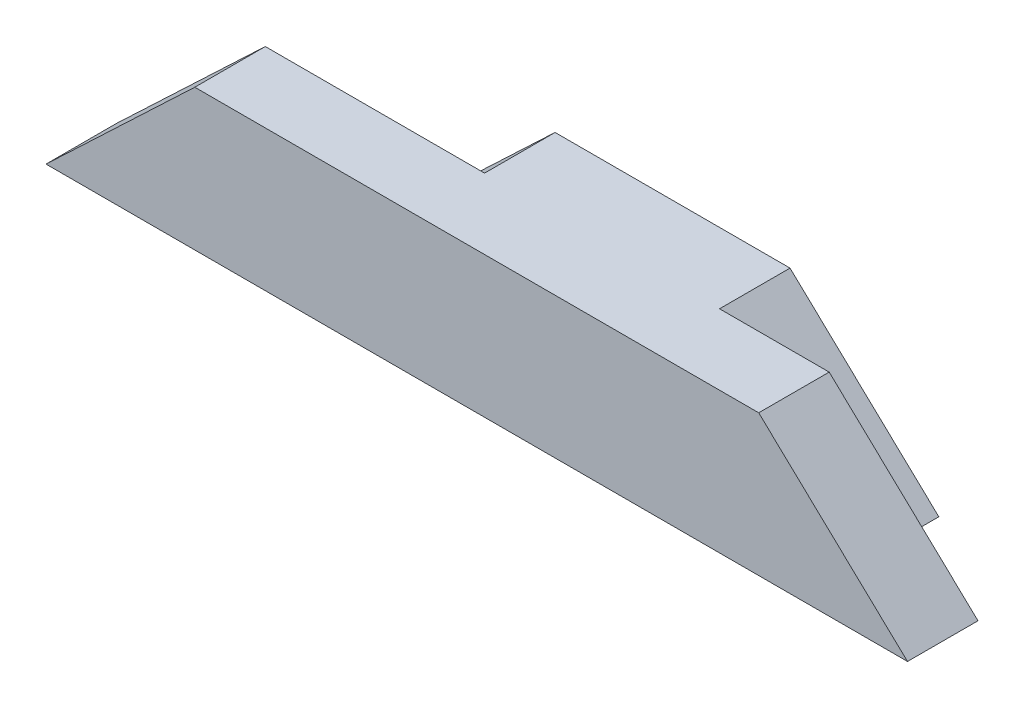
from build123d import *

# Parameters (mm, degrees)
ESQUISSE1_W             = 62
ESQUISSE1_H             = 9
EXTRUSION1_DEPTH        = 9
ENL_V_MAT_EXTRU_2_DEPTH = 9
ENL_V_MAT_EXTRU_3_DEPTH = 4.5
ENL_V_MAT_EXTRU_4_DEPTH = 10


with BuildPart() as part:
    # Esquisse1 → Extrusion1 (new body)
    with BuildSketch(Plane.XY):
        with Locations((31, 4.5)):
            Rectangle(ESQUISSE1_W, ESQUISSE1_H)
    extrude(amount=EXTRUSION1_DEPTH)

    # Esquisse2 → Enl_v. mat.-Extru.2 (cut)
    with BuildSketch(Plane.XY.offset(9)):
        Polygon((62, 9), (52.5, 9), (62, 0), align=None)
        Polygon((0, 9), (9.5, 9), (0, 0), align=None)
    extrude(amount=-ENL_V_MAT_EXTRU_2_DEPTH, mode=Mode.SUBTRACT)

    # Esquisse3 → Enl_v. mat.-Extru.3 (cut)
    with BuildSketch(Plane(origin=(0, 0, 0), x_dir=(-1, 0, 0), z_dir=(0, 0, -1))):
        Polygon((-9.5, 9), (-23.5, 9), (-14, 0), (0, 0), align=None)
        Polygon((-52.5, 9), (-38.5, 9), (-48, 0), (-62, 0), align=None)
    extrude(amount=-ENL_V_MAT_EXTRU_3_DEPTH, mode=Mode.SUBTRACT)

    # Esquisse4 → Enl_v. mat.-Extru.4 (cut)
    with BuildSketch(Plane(origin=(0, 0, 4.5), x_dir=(-1, 0, 0), z_dir=(0, 0, -1))):
        Polygon((-62, 0), (-55, 0), (-45.5, 9), (-52.5, 9), align=None)
    extrude(amount=-ENL_V_MAT_EXTRU_4_DEPTH, mode=Mode.SUBTRACT)


solid = part.part
